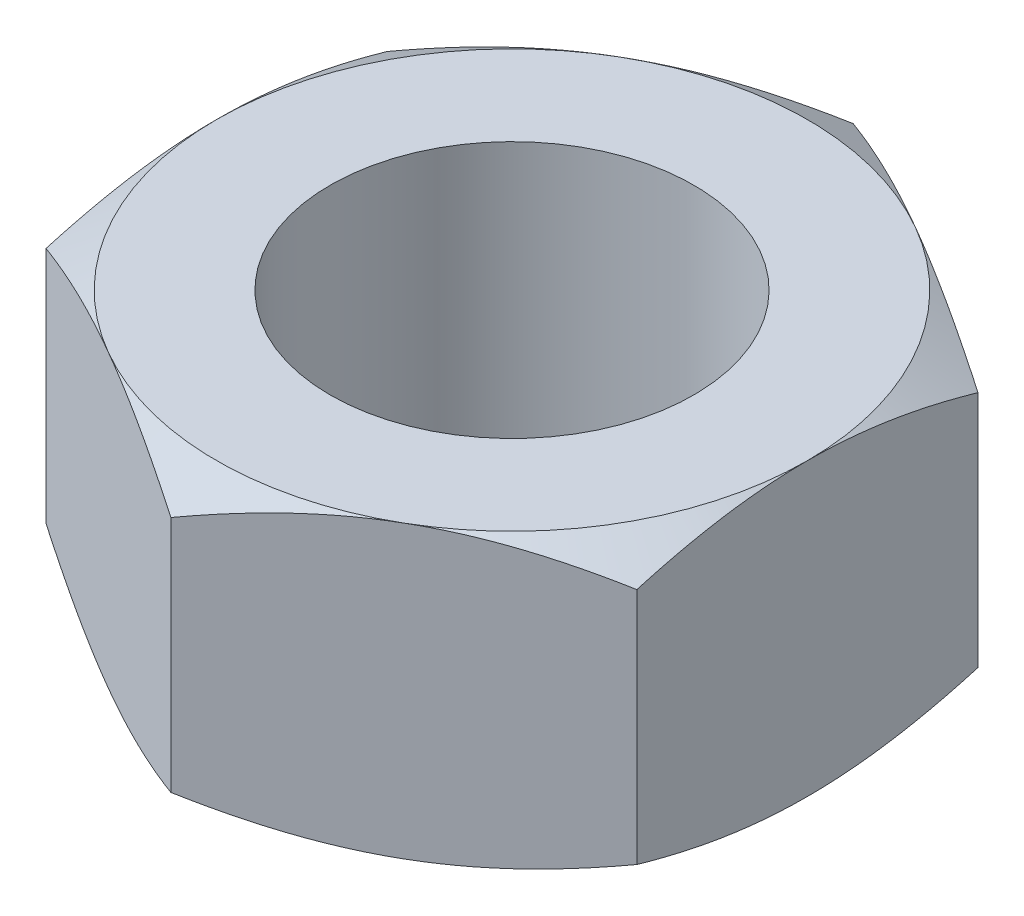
from build123d import *

# Parameters (mm, degrees)
ESQUISSE2_OUTSIDE_W          = 30.352
ESQUISSE2_OUTSIDE_H          = 30.352
ESQUISSE2_OUTSIDE_W_2        = 13
ESQUISSE2_OUTSIDE_H_2        = 22
ENL_V_MAT_EXTRU_1_DEPTH      = 17.821414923
R_P_TITION_CIRCULAIRE1_COUNT = 3
R_P_TITION_CIRCULAIRE1_ANGLE = 120
ESQUISSE3_R                  = 4
ENL_V_MAT_EXTRU_2_DEPTH      = 12.812846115


with BuildPart() as part:
    # Esquisse1 → Base-R_volution (revolve)
    with BuildSketch(Plane.XY, mode=Mode.PRIVATE) as base_r_volution_sk:
        Polygon((-6.5, 6.4), (0, 6.4), (0, 0), (-6.5, 0), (-11, 2.598076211), (-11, 3.801923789), align=None)
    revolve(base_r_volution_sk.sketch.rotate(Axis((0, 10, 0), (0, -1, 0)), 270), axis=Axis((0, 10, 0), (0, -1, 0)))

    # Esquisse2 outside → Enl_v. mat.-Extru.1 (cut, through all)
    with BuildSketch(Plane(origin=(0, 6.4, 0), x_dir=(-1, 0, 0), z_dir=(0, 1, 0))):
        Rectangle(ESQUISSE2_OUTSIDE_W, ESQUISSE2_OUTSIDE_H)
        Rectangle(ESQUISSE2_OUTSIDE_W_2, ESQUISSE2_OUTSIDE_H_2, mode=Mode.SUBTRACT)
    enl_v_mat_extru_1 = extrude(amount=-ENL_V_MAT_EXTRU_1_DEPTH, mode=Mode.SUBTRACT)

    # R_p_tition circulaire1: Enl_v. mat.-Extru.1 ×3 about axis
    r_p_tition_circulaire1_axis = Axis((0, 10, 0), (0, -1, 0))
    for i in range(1, R_P_TITION_CIRCULAIRE1_COUNT):
        add(enl_v_mat_extru_1.rotate(r_p_tition_circulaire1_axis, i * R_P_TITION_CIRCULAIRE1_ANGLE / (R_P_TITION_CIRCULAIRE1_COUNT - 1)), mode=Mode.SUBTRACT)

    # Esquisse3 → Enl_v. mat.-Extru.2 (cut, through all)
    with BuildSketch(Plane(origin=(0, 6.4, 0), x_dir=(-1, 0, 0), z_dir=(0, 1, 0))):
        with Locations(Location((0, 0, 0), (0, 0, 90))):
            Circle(ESQUISSE3_R)
    extrude(amount=-ENL_V_MAT_EXTRU_2_DEPTH, mode=Mode.SUBTRACT)


solid = part.part
